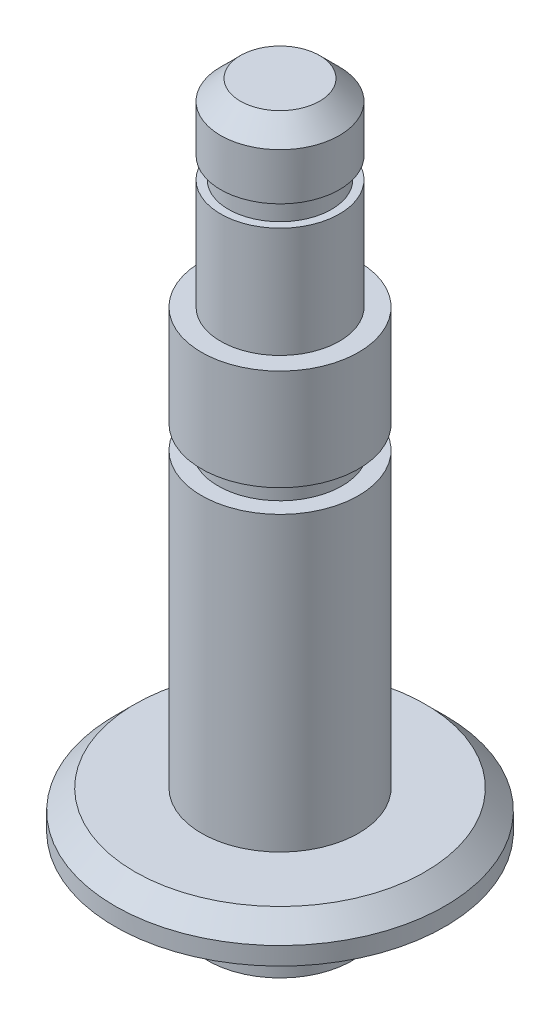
from build123d import *

# Parameters (mm, degrees)
CHAMFER2_SIZE = 0.762
SKETCH3_W     = 0.64135
SKETCH3_H     = 0.889
CHAMFER3_SIZE = 0.762
SKETCH4_W     = 0.3048
SKETCH4_H     = 0.809869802


with BuildPart() as part:
    # Sketch2 → Revolve1 (revolve)
    with BuildSketch(Plane(origin=(0, 0, 0), x_dir=(0, 0, -1), z_dir=(1, 0, 0))):
        Polygon((2.778125, 0), (6.35, 0), (6.35, 1.4478), (3.0226, 1.4478), (3.0226, 17.4752), (2.286, 17.4752), (2.286, 25.0952), (0, 25.0952), (0, -2.921), (2.778125, -2.921), align=None)
    revolve(axis=Axis((0, 0, 0), (0, 1, 0)))

    # Chamfer2
    chamfer2_edges = [part.edges().sort_by_distance(p)[0] for p in [
        (0, 1.4478, 6.35),
    ]]
    chamfer(chamfer2_edges, length=CHAMFER2_SIZE)

    # Sketch3 → Cut-Revolve1 (revolve, cut)
    with BuildSketch(Plane(origin=(0, 0, 0), x_dir=(0, 0, -1), z_dir=(1, 0, 0))):
        with Locations((2.701925, 13.1445)):
            Rectangle(SKETCH3_W, SKETCH3_H)
    revolve(axis=Axis((0, 0, 0), (0, 1, 0)), mode=Mode.SUBTRACT)

    # Chamfer3
    chamfer3_edges = [part.edges().sort_by_distance(p)[0] for p in [
        (0, 25.0952, 2.286),
    ]]
    chamfer(chamfer3_edges, length=CHAMFER3_SIZE)

    # Sketch4 → Cut-Revolve2 (revolve, cut)
    with BuildSketch(Plane(origin=(0, 0, 0), x_dir=(0, 0, -1), z_dir=(1, 0, 0))):
        with Locations((2.1336, 22.121934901)):
            Rectangle(SKETCH4_W, SKETCH4_H)
    revolve(axis=Axis((0, 0, 0), (0, 1, 0)), mode=Mode.SUBTRACT)


solid = part.part
